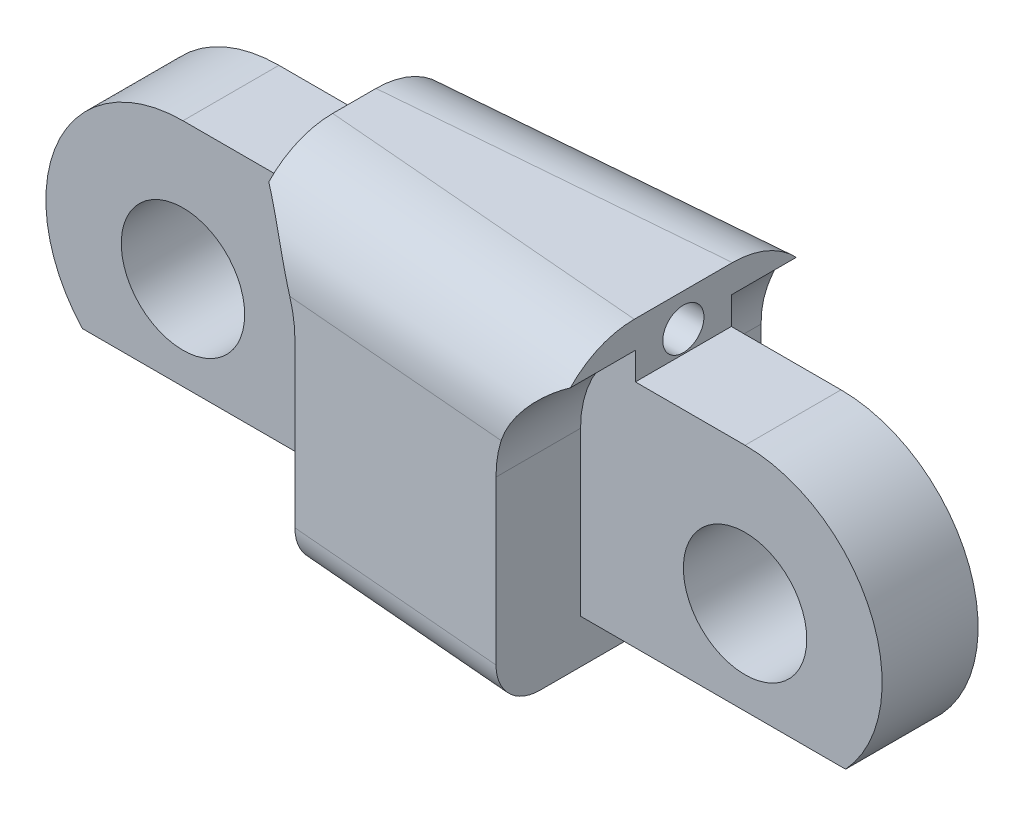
from build123d import *

# Parameters (mm, degrees)
BOSS_EXTRUDE1_DEPTH  = 19.05
FILLET1_R            = 5.08
SKETCH2_W            = 5.55625
SKETCH2_H            = 15.875
BOSS_EXTRUDE2_DEPTH  = 6.35
SKETCH3_W            = 5.55625
SKETCH3_H            = 15.875
BOSS_EXTRUDE3_DEPTH  = 7.14375
SKETCH4_W            = 5.55625
SKETCH4_H            = 7.9375
REVOLVE1_ANGLE       = 180
SKETCH5_W            = 5.55625
SKETCH5_H            = 7.9375
REVOLVE2_ANGLE       = 180
SKETCH6_R            = 3.571875
CUT_EXTRUDE1_DEPTH   = 40.863718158
FILLET2_R            = 2.54
CUT_EXTRUDE2_DEPTH   = 40.863718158
MIRROR2_COPY_1_DEPTH = 40.863718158
SKETCH8_R            = 1.190625
CUT_EXTRUDE3_DEPTH   = 19.05
SKETCH9_W            = 17.4625
SKETCH9_H            = 2.54
CUT_EXTRUDE4_DEPTH   = 6.35
CUT_EXTRUDE6_START   = -12.7
SKETCH10_R           = 1.190625
CUT_EXTRUDE6_DEPTH   = 12.7


with BuildPart() as part:
    # Sketch1 → Boss-Extrude1 (new body)
    with BuildSketch(Plane(origin=(0, 0, 0), x_dir=(1, 0, 0), z_dir=(0, 1, 0))):
        Polygon((0, -6.35), (0, 6.35), (19.05, 7.9375), (19.05, -7.9375), align=None)
    extrude(amount=BOSS_EXTRUDE1_DEPTH)

    # Fillet1
    fillet1_edges = [part.edges().sort_by_distance(p)[0] for p in [
        (9.525, 19.05, 7.14375),
        (9.525, 19.05, -7.14375),
    ]]
    fillet(fillet1_edges, radius=FILLET1_R)

    # Sketch2 → Boss-Extrude2 (add)
    with BuildSketch(Plane(origin=(19.05, 0, 0), x_dir=(0, 0, -1), z_dir=(1, 0, 0))):
        with Locations((0, 7.9375)):
            Rectangle(SKETCH2_W, SKETCH2_H)
    extrude(amount=BOSS_EXTRUDE2_DEPTH)

    # Sketch3 → Boss-Extrude3 (add)
    with BuildSketch(Plane.ZY):
        with Locations((0, 7.9375)):
            Rectangle(SKETCH3_W, SKETCH3_H)
    extrude(amount=BOSS_EXTRUDE3_DEPTH)

    # Sketch4 → Revolve1 (revolve)
    with BuildSketch(Plane(origin=(25.4, 0, 0), x_dir=(0, 0, -1), z_dir=(1, 0, 0))):
        with Locations((0, 3.96875)):
            Rectangle(SKETCH4_W, SKETCH4_H)
    revolve(axis=Axis((25.4, 7.9375, 2.778125), (0, 0, 1)), revolution_arc=REVOLVE1_ANGLE)

    # Sketch5 → Revolve2 (revolve)
    with BuildSketch(Plane.ZY.offset(7.14375)):
        with Locations((0, 3.96875)):
            Rectangle(SKETCH5_W, SKETCH5_H)
    revolve(axis=Axis((-7.14375, 7.9375, -2.778125), (0, 0, -1)), revolution_arc=REVOLVE2_ANGLE)

    # Sketch6 → Cut-Extrude1 (cut, through all)
    with BuildSketch(Plane.XY.offset(2.778125)):
        with Locations((25.4, 7.9375)):
            Circle(SKETCH6_R)
        with Locations((-7.14375, 7.9375)):
            Circle(SKETCH6_R)
    extrude(amount=-CUT_EXTRUDE1_DEPTH, mode=Mode.SUBTRACT)

    # Fillet2
    fillet2_edges = [part.edges().sort_by_distance(p)[0] for p in [
        (9.525, 0, 7.14375),
        (9.525, 0, -7.14375),
    ]]
    fillet(fillet2_edges, radius=FILLET2_R)

    # Sketch7 → Cut-Extrude2 (cut, through all)
    with BuildSketch(Plane.XY.offset(2.778125)):
        with BuildLine():
            Line((15.875, 0), (15.875, 11.963238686))
            ThreePointArc((15.875, 11.963238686), (16.725738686, 15.138238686), (19.05, 17.4625))
            Line((19.05, 17.4625), (19.05, 0))
            Line((19.05, 0), (15.875, 0))
        make_face()
    cut_extrude2 = extrude(amount=CUT_EXTRUDE2_DEPTH, mode=Mode.SUBTRACT)

    # Mirror1: Cut-Extrude2 across plane
    add(cut_extrude2.mirror(Plane.XY), mode=Mode.SUBTRACT)

    # Mirror2: Cut-Extrude2 across plane
    add(cut_extrude2.mirror(Plane(origin=(9.525, 0, 0), x_dir=(0, 0, 1), z_dir=(1, 0, 0))), mode=Mode.SUBTRACT)

    # Mirror2 copy 1 sketch → Mirror2 copy 1 (cut, through all)
    with BuildSketch(Plane(origin=(19.05, 0, -2.778125), x_dir=(-1, 0, 0), z_dir=(0, 0, -1))):
        with BuildLine():
            Line((15.875, 0), (15.875, 11.963238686))
            ThreePointArc((15.875, 11.963238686), (16.725738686, 15.138238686), (19.05, 17.4625))
            Line((19.05, 17.4625), (19.05, 0))
            Line((19.05, 0), (15.875, 0))
        make_face()
    extrude(amount=MIRROR2_COPY_1_DEPTH, mode=Mode.SUBTRACT)

    # Sketch8 → Cut-Extrude3 (cut)
    with BuildSketch(Plane(origin=(19.05, 0, 0), x_dir=(0, 0, -1), z_dir=(1, 0, 0))):
        with Locations((0, 17.145)):
            Circle(SKETCH8_R)
    extrude(amount=-CUT_EXTRUDE3_DEPTH, mode=Mode.SUBTRACT)

    # Sketch9 → Cut-Extrude4 (cut)
    with BuildSketch(Plane.XY.offset(2.778125)):
        with Locations((24.60625, 1.27)):
            Rectangle(SKETCH9_W, SKETCH9_H)
    cut_extrude4 = extrude(amount=-CUT_EXTRUDE4_DEPTH, mode=Mode.SUBTRACT)

    # Mirror3: Cut-Extrude4 across plane
    add(cut_extrude4.mirror(Plane(origin=(9.525, 0, 0), x_dir=(0, 0, 1), z_dir=(1, 0, 0))), mode=Mode.SUBTRACT)

    # Sketch10 → Cut-Extrude6 (cut)
    with BuildSketch(Plane(origin=(15.875, 0, 0), x_dir=(0, 0, -1), z_dir=(1, 0, 0)).offset(CUT_EXTRUDE6_START)):
        with Locations(Location((0, 1.778, 0), (0, 0, 39.7918195))):
            Circle(SKETCH10_R)
    extrude(amount=CUT_EXTRUDE6_DEPTH, mode=Mode.SUBTRACT)


solid = part.part
